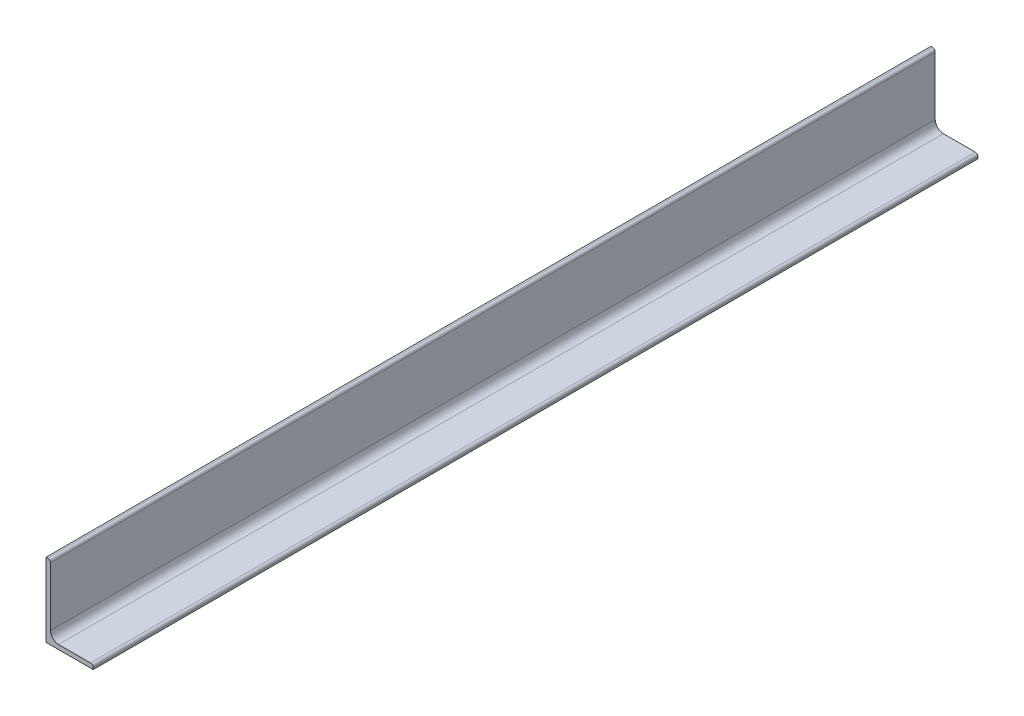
from build123d import *

# Parameters (mm, degrees)
EXTRUDE_1_DEPTH = 600


with BuildPart() as part:
    # Sketch 1 → Extrude 1 (new body)
    with BuildSketch(Plane.XY):
        with BuildLine():
            Line((0, 0), (0, 50))
            Line((0, 50), (1.2, 50))
            ThreePointArc((1.2, 50), (2.472792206, 49.472792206), (3, 48.2))
            Line((3, 48.2), (3, 8.5))
            ThreePointArc((3, 8.5), (4.610912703, 4.610912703), (8.5, 3))
            Line((8.5, 3), (30.2, 3))
            ThreePointArc((30.2, 3), (31.472792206, 2.472792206), (32, 1.2))
            Line((32, 1.2), (32, 0))
            Line((32, 0), (0, 0))
        make_face()
    extrude(amount=EXTRUDE_1_DEPTH)


solid = part.part
